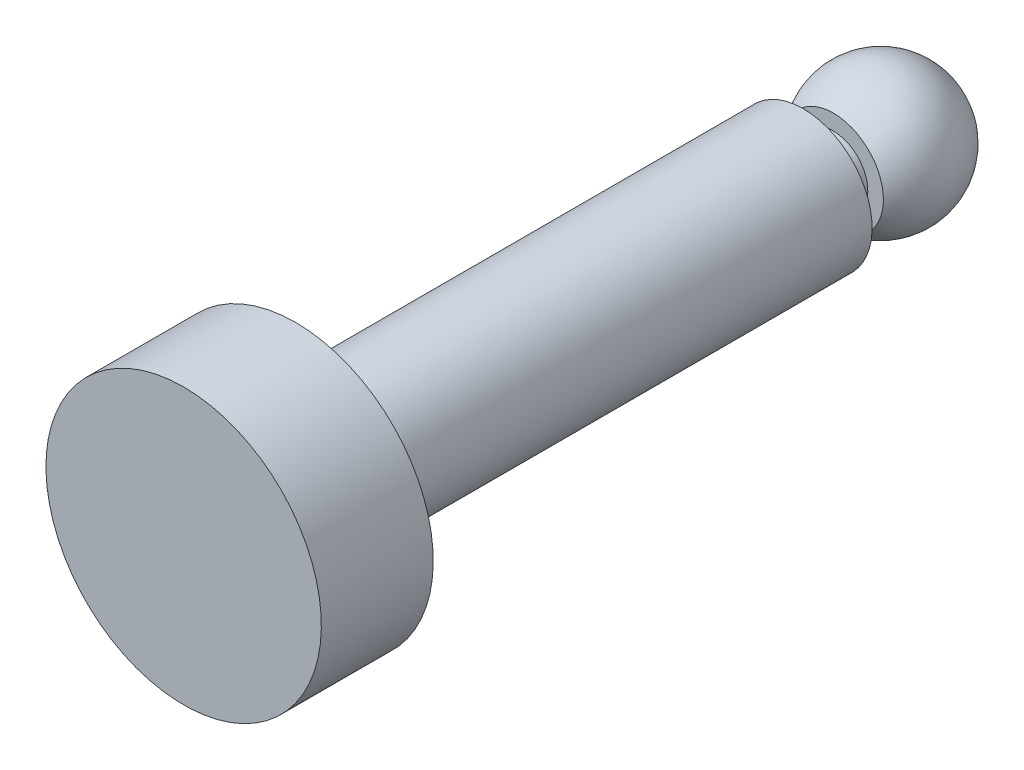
ISO-10303-21;
HEADER;
FILE_DESCRIPTION(('STEP AP214'),'2;1');
FILE_NAME('part.step','',(''),(''),'','','');
FILE_SCHEMA(('AUTOMOTIVE_DESIGN { 1 0 10303 214 1 1 1 1 }'));
ENDSEC;
DATA;
#1=APPLICATION_CONTEXT('core data for automotive mechanical design processes');
#2=APPLICATION_PROTOCOL_DEFINITION('international standard','automotive_design',2000,#1);
#3=PRODUCT_CONTEXT('',#1,'mechanical');
#4=PRODUCT('Part','Part','',(#3));
#5=PRODUCT_RELATED_PRODUCT_CATEGORY('part','',(#4));
#6=PRODUCT_DEFINITION_FORMATION('','',#4);
#7=PRODUCT_DEFINITION_CONTEXT('part definition',#1,'design');
#8=PRODUCT_DEFINITION('design','',#6,#7);
#9=PRODUCT_DEFINITION_SHAPE('','',#8);
#10=(LENGTH_UNIT() NAMED_UNIT(*) SI_UNIT(.MILLI.,.METRE.));
#11=(NAMED_UNIT(*) PLANE_ANGLE_UNIT() SI_UNIT($,.RADIAN.));
#12=(NAMED_UNIT(*) SI_UNIT($,.STERADIAN.) SOLID_ANGLE_UNIT());
#13=UNCERTAINTY_MEASURE_WITH_UNIT(LENGTH_MEASURE(1.E-05),#10,'distance_accuracy_value','');
#14=(GEOMETRIC_REPRESENTATION_CONTEXT(3) GLOBAL_UNCERTAINTY_ASSIGNED_CONTEXT((#13)) GLOBAL_UNIT_ASSIGNED_CONTEXT((#10,
#11,#12)) REPRESENTATION_CONTEXT('',''));
#15=CARTESIAN_POINT('',(0.,0.,0.));
#16=DIRECTION('',(0.,0.,1.));
#17=DIRECTION('',(1.,0.,0.));
#18=AXIS2_PLACEMENT_3D('',#15,#16,#17);
#19=CARTESIAN_POINT('',(0.,-16.,89.));
#20=DIRECTION('',(0.,0.,-1.));
#21=DIRECTION('',(0.,-1.,0.));
#22=AXIS2_PLACEMENT_3D('',#19,#20,#21);
#23=PLANE('',#22);
#24=CARTESIAN_POINT('',(0.,0.,89.));
#25=DIRECTION('',(0.,0.,1.));
#26=DIRECTION('',(0.,1.,0.));
#27=AXIS2_PLACEMENT_3D('',#24,#25,#26);
#28=CIRCLE('',#27,16.);
#29=CARTESIAN_POINT('',(0.,16.,89.));
#30=VERTEX_POINT('',#29);
#31=EDGE_CURVE('E37',#30,#30,#28,.T.);
#32=ORIENTED_EDGE('',*,*,#31,.T.);
#33=EDGE_LOOP('',(#32));
#34=FACE_BOUND('',#33,.T.);
#35=ADVANCED_FACE('F12',(#34),#23,.F.);
#36=CARTESIAN_POINT('',(0.,0.,8.));
#37=DIRECTION('',(0.,-1.,0.));
#38=DIRECTION('',(-1.,0.,0.));
#39=AXIS2_PLACEMENT_3D('',#36,#37,#38);
#40=SPHERICAL_SURFACE('',#39,8.);
#41=CARTESIAN_POINT('',(0.,0.,8.));
#42=DIRECTION('',(0.,0.,1.));
#43=DIRECTION('',(0.,1.,0.));
#44=AXIS2_PLACEMENT_3D('',#41,#42,#43);
#45=SPHERICAL_SURFACE('',#44,8.);
#46=CARTESIAN_POINT('',(0.,0.,13.5));
#47=DIRECTION('',(0.,0.,1.));
#48=DIRECTION('',(0.,1.,0.));
#49=AXIS2_PLACEMENT_3D('',#46,#47,#48);
#50=CIRCLE('',#49,5.80947501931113);
#51=CARTESIAN_POINT('',(0.,5.80947501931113,13.5));
#52=VERTEX_POINT('',#51);
#53=EDGE_CURVE('E8',#52,#52,#50,.T.);
#54=ORIENTED_EDGE('',*,*,#53,.F.);
#55=EDGE_LOOP('',(#54));
#56=FACE_BOUND('',#55,.T.);
#57=ADVANCED_FACE('F67',(#56),#45,.T.);
#58=CARTESIAN_POINT('',(0.,-5.80947501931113,13.5));
#59=DIRECTION('',(0.,0.,-1.));
#60=DIRECTION('',(0.,-1.,0.));
#61=AXIS2_PLACEMENT_3D('',#58,#59,#60);
#62=PLANE('',#61);
#63=CARTESIAN_POINT('',(0.,0.,13.5));
#64=DIRECTION('',(0.,0.,1.));
#65=DIRECTION('',(0.,1.,0.));
#66=AXIS2_PLACEMENT_3D('',#63,#64,#65);
#67=CIRCLE('',#66,4.);
#68=CARTESIAN_POINT('',(0.,4.,13.5));
#69=VERTEX_POINT('',#68);
#70=EDGE_CURVE('E18',#69,#69,#67,.T.);
#71=ORIENTED_EDGE('',*,*,#70,.F.);
#72=EDGE_LOOP('',(#71));
#73=FACE_BOUND('',#72,.T.);
#74=ORIENTED_EDGE('',*,*,#53,.T.);
#75=EDGE_LOOP('',(#74));
#76=FACE_BOUND('',#75,.T.);
#77=ADVANCED_FACE('F71',(#73,#76),#62,.F.);
#78=CARTESIAN_POINT('',(0.,0.,8.3));
#79=DIRECTION('',(0.,0.,1.));
#80=DIRECTION('',(0.,1.,0.));
#81=AXIS2_PLACEMENT_3D('',#78,#79,#80);
#82=CYLINDRICAL_SURFACE('',#81,4.);
#83=ORIENTED_EDGE('',*,*,#70,.T.);
#84=EDGE_LOOP('',(#83));
#85=FACE_BOUND('',#84,.T.);
#86=CARTESIAN_POINT('',(0.,0.,17.));
#87=DIRECTION('',(0.,0.,1.));
#88=DIRECTION('',(0.,1.,0.));
#89=AXIS2_PLACEMENT_3D('',#86,#87,#88);
#90=CIRCLE('',#89,4.);
#91=CARTESIAN_POINT('',(0.,4.,17.));
#92=VERTEX_POINT('',#91);
#93=EDGE_CURVE('E22',#92,#92,#90,.T.);
#94=ORIENTED_EDGE('',*,*,#93,.F.);
#95=EDGE_LOOP('',(#94));
#96=FACE_BOUND('',#95,.T.);
#97=ADVANCED_FACE('F63',(#85,#96),#82,.T.);
#98=CARTESIAN_POINT('',(0.,-8.,17.));
#99=DIRECTION('',(0.,0.,-1.));
#100=DIRECTION('',(0.,-1.,0.));
#101=AXIS2_PLACEMENT_3D('',#98,#99,#100);
#102=PLANE('',#101);
#103=ORIENTED_EDGE('',*,*,#93,.T.);
#104=EDGE_LOOP('',(#103));
#105=FACE_BOUND('',#104,.T.);
#106=CARTESIAN_POINT('',(0.,0.,17.));
#107=DIRECTION('',(0.,0.,1.));
#108=DIRECTION('',(0.,1.,0.));
#109=AXIS2_PLACEMENT_3D('',#106,#107,#108);
#110=CIRCLE('',#109,8.);
#111=CARTESIAN_POINT('',(0.,8.,17.));
#112=VERTEX_POINT('',#111);
#113=EDGE_CURVE('E26',#112,#112,#110,.T.);
#114=ORIENTED_EDGE('',*,*,#113,.F.);
#115=EDGE_LOOP('',(#114));
#116=FACE_BOUND('',#115,.T.);
#117=ADVANCED_FACE('F56',(#105,#116),#102,.T.);
#118=CARTESIAN_POINT('',(0.,0.,8.3));
#119=DIRECTION('',(0.,0.,1.));
#120=DIRECTION('',(0.,1.,0.));
#121=AXIS2_PLACEMENT_3D('',#118,#119,#120);
#122=CYLINDRICAL_SURFACE('',#121,8.);
#123=ORIENTED_EDGE('',*,*,#113,.T.);
#124=EDGE_LOOP('',(#123));
#125=FACE_BOUND('',#124,.T.);
#126=CARTESIAN_POINT('',(0.,0.,76.));
#127=DIRECTION('',(0.,0.,1.));
#128=DIRECTION('',(0.,1.,0.));
#129=AXIS2_PLACEMENT_3D('',#126,#127,#128);
#130=CIRCLE('',#129,8.);
#131=CARTESIAN_POINT('',(0.,8.,76.));
#132=VERTEX_POINT('',#131);
#133=EDGE_CURVE('E31',#132,#132,#130,.T.);
#134=ORIENTED_EDGE('',*,*,#133,.F.);
#135=EDGE_LOOP('',(#134));
#136=FACE_BOUND('',#135,.T.);
#137=ADVANCED_FACE('F51',(#125,#136),#122,.T.);
#138=CARTESIAN_POINT('',(0.,-8.,76.));
#139=DIRECTION('',(0.,0.,1.));
#140=DIRECTION('',(0.,1.,0.));
#141=AXIS2_PLACEMENT_3D('',#138,#139,#140);
#142=PLANE('',#141);
#143=CARTESIAN_POINT('',(0.,0.,76.));
#144=DIRECTION('',(0.,0.,1.));
#145=DIRECTION('',(0.,1.,0.));
#146=AXIS2_PLACEMENT_3D('',#143,#144,#145);
#147=CIRCLE('',#146,16.);
#148=CARTESIAN_POINT('',(0.,16.,76.));
#149=VERTEX_POINT('',#148);
#150=EDGE_CURVE('E34',#149,#149,#147,.T.);
#151=ORIENTED_EDGE('',*,*,#150,.F.);
#152=EDGE_LOOP('',(#151));
#153=FACE_BOUND('',#152,.T.);
#154=ORIENTED_EDGE('',*,*,#133,.T.);
#155=EDGE_LOOP('',(#154));
#156=FACE_BOUND('',#155,.T.);
#157=ADVANCED_FACE('F45',(#153,#156),#142,.F.);
#158=CARTESIAN_POINT('',(0.,0.,8.3));
#159=DIRECTION('',(0.,0.,1.));
#160=DIRECTION('',(0.,1.,0.));
#161=AXIS2_PLACEMENT_3D('',#158,#159,#160);
#162=CYLINDRICAL_SURFACE('',#161,16.);
#163=ORIENTED_EDGE('',*,*,#31,.F.);
#164=EDGE_LOOP('',(#163));
#165=FACE_BOUND('',#164,.T.);
#166=ORIENTED_EDGE('',*,*,#150,.T.);
#167=EDGE_LOOP('',(#166));
#168=FACE_BOUND('',#167,.T.);
#169=ADVANCED_FACE('F42',(#165,#168),#162,.T.);
#170=CLOSED_SHELL('',(#35,#57,#77,#97,#117,#137,#157,#169));
#171=MANIFOLD_SOLID_BREP('B1',#170);
#172=ADVANCED_BREP_SHAPE_REPRESENTATION('',(#18,#171),#14);
#173=SHAPE_DEFINITION_REPRESENTATION(#9,#172);
ENDSEC;
END-ISO-10303-21;
